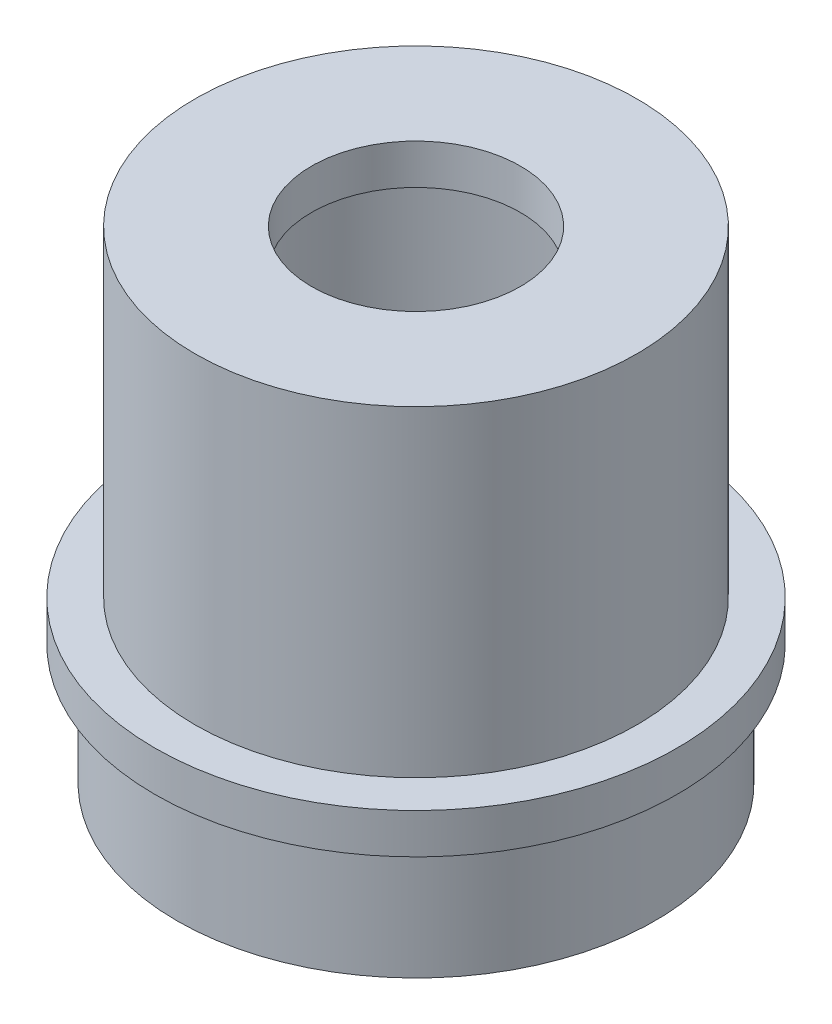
ISO-10303-21;
HEADER;
FILE_DESCRIPTION(('STEP AP214'),'2;1');
FILE_NAME('part.step','',(''),(''),'','','');
FILE_SCHEMA(('AUTOMOTIVE_DESIGN { 1 0 10303 214 1 1 1 1 }'));
ENDSEC;
DATA;
#1=APPLICATION_CONTEXT('core data for automotive mechanical design processes');
#2=APPLICATION_PROTOCOL_DEFINITION('international standard','automotive_design',2000,#1);
#3=PRODUCT_CONTEXT('',#1,'mechanical');
#4=PRODUCT('Part','Part','',(#3));
#5=PRODUCT_RELATED_PRODUCT_CATEGORY('part','',(#4));
#6=PRODUCT_DEFINITION_FORMATION('','',#4);
#7=PRODUCT_DEFINITION_CONTEXT('part definition',#1,'design');
#8=PRODUCT_DEFINITION('design','',#6,#7);
#9=PRODUCT_DEFINITION_SHAPE('','',#8);
#10=(LENGTH_UNIT() NAMED_UNIT(*) SI_UNIT(.MILLI.,.METRE.));
#11=(NAMED_UNIT(*) PLANE_ANGLE_UNIT() SI_UNIT($,.RADIAN.));
#12=(NAMED_UNIT(*) SI_UNIT($,.STERADIAN.) SOLID_ANGLE_UNIT());
#13=UNCERTAINTY_MEASURE_WITH_UNIT(LENGTH_MEASURE(1.E-05),#10,'distance_accuracy_value','');
#14=(GEOMETRIC_REPRESENTATION_CONTEXT(3) GLOBAL_UNCERTAINTY_ASSIGNED_CONTEXT((#13)) GLOBAL_UNIT_ASSIGNED_CONTEXT((#10,
#11,#12)) REPRESENTATION_CONTEXT('',''));
#15=CARTESIAN_POINT('',(0.,0.,0.));
#16=DIRECTION('',(0.,0.,1.));
#17=DIRECTION('',(1.,0.,0.));
#18=AXIS2_PLACEMENT_3D('',#15,#16,#17);
#19=CARTESIAN_POINT('',(0.,1.,0.));
#20=DIRECTION('',(0.,1.,0.));
#21=DIRECTION('',(0.,0.,1.));
#22=AXIS2_PLACEMENT_3D('',#19,#20,#21);
#23=CYLINDRICAL_SURFACE('',#22,5.);
#24=CARTESIAN_POINT('',(0.,11.,0.));
#25=DIRECTION('',(0.,1.,0.));
#26=DIRECTION('',(0.,0.,1.));
#27=AXIS2_PLACEMENT_3D('',#24,#25,#26);
#28=CIRCLE('',#27,5.);
#29=CARTESIAN_POINT('',(0.,11.,5.));
#30=VERTEX_POINT('',#29);
#31=EDGE_CURVE('E46',#30,#30,#28,.F.);
#32=ORIENTED_EDGE('',*,*,#31,.F.);
#33=EDGE_LOOP('',(#32));
#34=FACE_BOUND('',#33,.T.);
#35=CARTESIAN_POINT('',(0.,3.,0.));
#36=DIRECTION('',(0.,-1.,0.));
#37=DIRECTION('',(0.,0.,-1.));
#38=AXIS2_PLACEMENT_3D('',#35,#36,#37);
#39=CIRCLE('',#38,5.);
#40=CARTESIAN_POINT('',(0.,3.,-5.));
#41=VERTEX_POINT('',#40);
#42=EDGE_CURVE('E11',#41,#41,#39,.F.);
#43=ORIENTED_EDGE('',*,*,#42,.F.);
#44=EDGE_LOOP('',(#43));
#45=FACE_BOUND('',#44,.T.);
#46=ADVANCED_FACE('F42',(#34,#45),#23,.F.);
#47=CARTESIAN_POINT('',(0.,11.,0.));
#48=DIRECTION('',(0.,1.,0.));
#49=DIRECTION('',(0.,0.,1.));
#50=AXIS2_PLACEMENT_3D('',#47,#48,#49);
#51=PLANE('',#50);
#52=CARTESIAN_POINT('',(0.,11.,0.));
#53=DIRECTION('',(0.,1.,0.));
#54=DIRECTION('',(0.,0.,1.));
#55=AXIS2_PLACEMENT_3D('',#52,#53,#54);
#56=CIRCLE('',#55,2.6);
#57=CARTESIAN_POINT('',(0.,11.,2.6));
#58=VERTEX_POINT('',#57);
#59=EDGE_CURVE('E59',#58,#58,#56,.T.);
#60=ORIENTED_EDGE('',*,*,#59,.T.);
#61=EDGE_LOOP('',(#60));
#62=FACE_BOUND('',#61,.T.);
#63=ORIENTED_EDGE('',*,*,#31,.T.);
#64=EDGE_LOOP('',(#63));
#65=FACE_BOUND('',#64,.T.);
#66=ADVANCED_FACE('F108',(#62,#65),#51,.F.);
#67=CARTESIAN_POINT('',(0.,11.,0.));
#68=DIRECTION('',(0.,1.,0.));
#69=DIRECTION('',(0.,0.,1.));
#70=AXIS2_PLACEMENT_3D('',#67,#68,#69);
#71=CYLINDRICAL_SURFACE('',#70,2.6);
#72=ORIENTED_EDGE('',*,*,#59,.F.);
#73=EDGE_LOOP('',(#72));
#74=FACE_BOUND('',#73,.T.);
#75=CARTESIAN_POINT('',(0.,12.,0.));
#76=DIRECTION('',(0.,1.,0.));
#77=DIRECTION('',(0.,0.,1.));
#78=AXIS2_PLACEMENT_3D('',#75,#76,#77);
#79=CIRCLE('',#78,2.6);
#80=CARTESIAN_POINT('',(0.,12.,2.6));
#81=VERTEX_POINT('',#80);
#82=EDGE_CURVE('E63',#81,#81,#79,.T.);
#83=ORIENTED_EDGE('',*,*,#82,.T.);
#84=EDGE_LOOP('',(#83));
#85=FACE_BOUND('',#84,.T.);
#86=ADVANCED_FACE('F77',(#74,#85),#71,.F.);
#87=CARTESIAN_POINT('',(0.,4.,0.));
#88=DIRECTION('',(0.,1.,0.));
#89=DIRECTION('',(0.,0.,1.));
#90=AXIS2_PLACEMENT_3D('',#87,#88,#89);
#91=PLANE('',#90);
#92=CARTESIAN_POINT('',(0.,4.,0.));
#93=DIRECTION('',(0.,1.,0.));
#94=DIRECTION('',(0.,0.,1.));
#95=AXIS2_PLACEMENT_3D('',#92,#93,#94);
#96=CIRCLE('',#95,5.5);
#97=CARTESIAN_POINT('',(0.,4.,5.5));
#98=VERTEX_POINT('',#97);
#99=EDGE_CURVE('E62',#98,#98,#96,.T.);
#100=ORIENTED_EDGE('',*,*,#99,.F.);
#101=EDGE_LOOP('',(#100));
#102=FACE_BOUND('',#101,.T.);
#103=CARTESIAN_POINT('',(0.,4.,0.));
#104=DIRECTION('',(0.,-1.,0.));
#105=DIRECTION('',(0.,0.,-1.));
#106=AXIS2_PLACEMENT_3D('',#103,#104,#105);
#107=CIRCLE('',#106,6.5);
#108=CARTESIAN_POINT('',(0.,4.,-6.5));
#109=VERTEX_POINT('',#108);
#110=EDGE_CURVE('E66',#109,#109,#107,.T.);
#111=ORIENTED_EDGE('',*,*,#110,.F.);
#112=EDGE_LOOP('',(#111));
#113=FACE_BOUND('',#112,.T.);
#114=ADVANCED_FACE('F73',(#102,#113),#91,.T.);
#115=CARTESIAN_POINT('',(0.,12.,0.));
#116=DIRECTION('',(0.,1.,0.));
#117=DIRECTION('',(0.,0.,1.));
#118=AXIS2_PLACEMENT_3D('',#115,#116,#117);
#119=PLANE('',#118);
#120=ORIENTED_EDGE('',*,*,#82,.F.);
#121=EDGE_LOOP('',(#120));
#122=FACE_BOUND('',#121,.T.);
#123=CARTESIAN_POINT('',(0.,12.,0.));
#124=DIRECTION('',(0.,1.,0.));
#125=DIRECTION('',(0.,0.,1.));
#126=AXIS2_PLACEMENT_3D('',#123,#124,#125);
#127=CIRCLE('',#126,5.5);
#128=CARTESIAN_POINT('',(0.,12.,5.5));
#129=VERTEX_POINT('',#128);
#130=EDGE_CURVE('E54',#129,#129,#127,.T.);
#131=ORIENTED_EDGE('',*,*,#130,.T.);
#132=EDGE_LOOP('',(#131));
#133=FACE_BOUND('',#132,.T.);
#134=ADVANCED_FACE('F76',(#122,#133),#119,.T.);
#135=CARTESIAN_POINT('',(0.,12.,0.));
#136=DIRECTION('',(0.,-1.,0.));
#137=DIRECTION('',(0.,0.,-1.));
#138=AXIS2_PLACEMENT_3D('',#135,#136,#137);
#139=CYLINDRICAL_SURFACE('',#138,5.5);
#140=ORIENTED_EDGE('',*,*,#130,.F.);
#141=EDGE_LOOP('',(#140));
#142=FACE_BOUND('',#141,.T.);
#143=ORIENTED_EDGE('',*,*,#99,.T.);
#144=EDGE_LOOP('',(#143));
#145=FACE_BOUND('',#144,.T.);
#146=ADVANCED_FACE('F71',(#142,#145),#139,.T.);
#147=CARTESIAN_POINT('',(0.,3.,0.));
#148=DIRECTION('',(0.,-1.,0.));
#149=DIRECTION('',(0.,0.,-1.));
#150=AXIS2_PLACEMENT_3D('',#147,#148,#149);
#151=PLANE('',#150);
#152=ORIENTED_EDGE('',*,*,#42,.T.);
#153=EDGE_LOOP('',(#152));
#154=FACE_BOUND('',#153,.T.);
#155=ADVANCED_FACE('F105',(#154),#151,.F.);
#156=CARTESIAN_POINT('',(0.,4.,0.));
#157=DIRECTION('',(0.,-1.,0.));
#158=DIRECTION('',(0.,0.,-1.));
#159=AXIS2_PLACEMENT_3D('',#156,#157,#158);
#160=CYLINDRICAL_SURFACE('',#159,6.5);
#161=ORIENTED_EDGE('',*,*,#110,.T.);
#162=EDGE_LOOP('',(#161));
#163=FACE_BOUND('',#162,.T.);
#164=CARTESIAN_POINT('',(0.,3.,0.));
#165=DIRECTION('',(0.,-1.,0.));
#166=DIRECTION('',(0.,0.,-1.));
#167=AXIS2_PLACEMENT_3D('',#164,#165,#166);
#168=CIRCLE('',#167,6.5);
#169=CARTESIAN_POINT('',(0.,3.,-6.5));
#170=VERTEX_POINT('',#169);
#171=EDGE_CURVE('E57',#170,#170,#168,.T.);
#172=ORIENTED_EDGE('',*,*,#171,.F.);
#173=EDGE_LOOP('',(#172));
#174=FACE_BOUND('',#173,.T.);
#175=ADVANCED_FACE('F96',(#163,#174),#160,.T.);
#176=CARTESIAN_POINT('',(0.,3.,0.));
#177=DIRECTION('',(0.,1.,0.));
#178=DIRECTION('',(0.,0.,1.));
#179=AXIS2_PLACEMENT_3D('',#176,#177,#178);
#180=PLANE('',#179);
#181=ORIENTED_EDGE('',*,*,#171,.T.);
#182=EDGE_LOOP('',(#181));
#183=FACE_BOUND('',#182,.T.);
#184=CARTESIAN_POINT('',(0.,3.,0.));
#185=DIRECTION('',(0.,-1.,0.));
#186=DIRECTION('',(0.,0.,-1.));
#187=AXIS2_PLACEMENT_3D('',#184,#185,#186);
#188=CIRCLE('',#187,5.95);
#189=CARTESIAN_POINT('',(0.,3.,-5.95));
#190=VERTEX_POINT('',#189);
#191=EDGE_CURVE('E83',#190,#190,#188,.T.);
#192=ORIENTED_EDGE('',*,*,#191,.F.);
#193=EDGE_LOOP('',(#192));
#194=FACE_BOUND('',#193,.T.);
#195=ADVANCED_FACE('F94',(#183,#194),#180,.F.);
#196=CARTESIAN_POINT('',(0.,3.,0.));
#197=DIRECTION('',(0.,-1.,0.));
#198=DIRECTION('',(0.,0.,-1.));
#199=AXIS2_PLACEMENT_3D('',#196,#197,#198);
#200=CYLINDRICAL_SURFACE('',#199,5.95);
#201=ORIENTED_EDGE('',*,*,#191,.T.);
#202=EDGE_LOOP('',(#201));
#203=FACE_BOUND('',#202,.T.);
#204=CARTESIAN_POINT('',(0.,0.,0.));
#205=DIRECTION('',(0.,-1.,0.));
#206=DIRECTION('',(0.,0.,-1.));
#207=AXIS2_PLACEMENT_3D('',#204,#205,#206);
#208=CIRCLE('',#207,5.95);
#209=CARTESIAN_POINT('',(0.,0.,-5.95));
#210=VERTEX_POINT('',#209);
#211=EDGE_CURVE('E85',#210,#210,#208,.T.);
#212=ORIENTED_EDGE('',*,*,#211,.F.);
#213=EDGE_LOOP('',(#212));
#214=FACE_BOUND('',#213,.T.);
#215=ADVANCED_FACE('F91',(#203,#214),#200,.T.);
#216=CARTESIAN_POINT('',(0.,0.,0.));
#217=DIRECTION('',(0.,1.,0.));
#218=DIRECTION('',(0.,0.,1.));
#219=AXIS2_PLACEMENT_3D('',#216,#217,#218);
#220=PLANE('',#219);
#221=ORIENTED_EDGE('',*,*,#211,.T.);
#222=EDGE_LOOP('',(#221));
#223=FACE_BOUND('',#222,.T.);
#224=ADVANCED_FACE('F44',(#223),#220,.F.);
#225=CLOSED_SHELL('',(#46,#66,#86,#114,#134,#146,#155,#175,#195,#215,#224));
#226=MANIFOLD_SOLID_BREP('B2',#225);
#227=ADVANCED_BREP_SHAPE_REPRESENTATION('',(#18,#226),#14);
#228=SHAPE_DEFINITION_REPRESENTATION(#9,#227);
ENDSEC;
END-ISO-10303-21;
